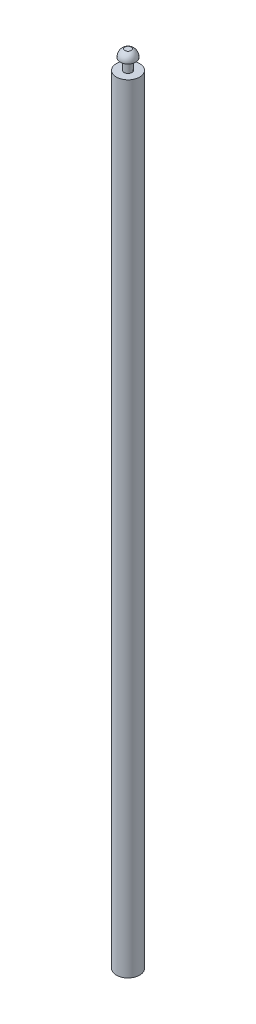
from build123d import *

# Parameters (mm, degrees)
SKETCH_4_R      = 0.75
EXTRUDE_1_DEPTH = 50


with BuildPart() as part:
    # Sketch 3 → Revolve 1 (revolve)
    with BuildSketch(Plane.XY, mode=Mode.PRIVATE) as revolve_1_sk:
        with BuildLine():
            Line((-0.25, 35.807250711), (-0.5, 35.807250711))
            ThreePointArc((-0.5, 35.807250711), (-0.430116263, 36.105320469), (-0.2, 36.307250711))
            Line((-0.2, 36.307250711), (0, 36.307250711))
            Line((0, 36.307250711), (0, 35.107250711))
            Line((0, 35.107250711), (-0.25, 35.107250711))
            Line((-0.25, 35.107250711), (-0.25, 35.807250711))
        make_face()
    revolve(revolve_1_sk.sketch.rotate(Axis((0, 0, 0), (0, 1, 0)), 270), axis=Axis((0, 0, 0), (0, 1, 0)))

    # Sketch 4 → Extrude 1 (add)
    with BuildSketch(Plane.XZ.offset(-35.107250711)):
        with Locations(Location((0, 0, 0), (0, 0, 270))):
            Circle(SKETCH_4_R)
    extrude(amount=EXTRUDE_1_DEPTH)


solid = part.part
